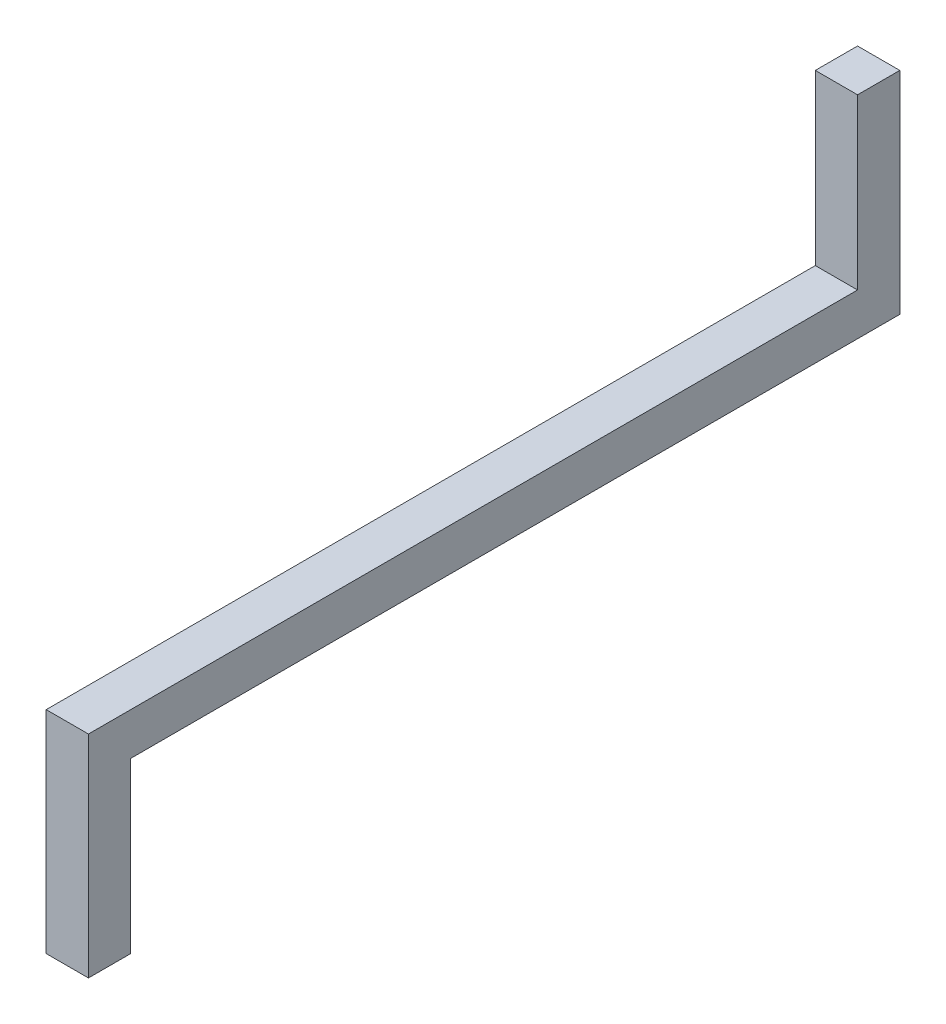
ISO-10303-21;
HEADER;
FILE_DESCRIPTION(('STEP AP214'),'2;1');
FILE_NAME('part.step','',(''),(''),'','','');
FILE_SCHEMA(('AUTOMOTIVE_DESIGN { 1 0 10303 214 1 1 1 1 }'));
ENDSEC;
DATA;
#1=APPLICATION_CONTEXT('core data for automotive mechanical design processes');
#2=APPLICATION_PROTOCOL_DEFINITION('international standard','automotive_design',2000,#1);
#3=PRODUCT_CONTEXT('',#1,'mechanical');
#4=PRODUCT('Part','Part','',(#3));
#5=PRODUCT_RELATED_PRODUCT_CATEGORY('part','',(#4));
#6=PRODUCT_DEFINITION_FORMATION('','',#4);
#7=PRODUCT_DEFINITION_CONTEXT('part definition',#1,'design');
#8=PRODUCT_DEFINITION('design','',#6,#7);
#9=PRODUCT_DEFINITION_SHAPE('','',#8);
#10=(LENGTH_UNIT() NAMED_UNIT(*) SI_UNIT(.MILLI.,.METRE.));
#11=(NAMED_UNIT(*) PLANE_ANGLE_UNIT() SI_UNIT($,.RADIAN.));
#12=(NAMED_UNIT(*) SI_UNIT($,.STERADIAN.) SOLID_ANGLE_UNIT());
#13=UNCERTAINTY_MEASURE_WITH_UNIT(LENGTH_MEASURE(1.E-05),#10,'distance_accuracy_value','');
#14=(GEOMETRIC_REPRESENTATION_CONTEXT(3) GLOBAL_UNCERTAINTY_ASSIGNED_CONTEXT((#13)) GLOBAL_UNIT_ASSIGNED_CONTEXT((#10,
#11,#12)) REPRESENTATION_CONTEXT('',''));
#15=CARTESIAN_POINT('',(0.,0.,0.));
#16=DIRECTION('',(0.,0.,1.));
#17=DIRECTION('',(1.,0.,0.));
#18=AXIS2_PLACEMENT_3D('',#15,#16,#17);
#19=CARTESIAN_POINT('',(3.175,0.,0.));
#20=DIRECTION('',(0.,0.,1.));
#21=DIRECTION('',(1.,0.,0.));
#22=AXIS2_PLACEMENT_3D('',#19,#20,#21);
#23=PLANE('',#22);
#24=DIRECTION('',(0.,1.,0.));
#25=VECTOR('',#24,1.);
#26=CARTESIAN_POINT('',(0.,0.,0.));
#27=LINE('',#26,#25);
#28=CARTESIAN_POINT('',(0.,0.,0.));
#29=VERTEX_POINT('',#28);
#30=CARTESIAN_POINT('',(0.,12.7,0.));
#31=VERTEX_POINT('',#30);
#32=EDGE_CURVE('E129',#29,#31,#27,.T.);
#33=ORIENTED_EDGE('',*,*,#32,.T.);
#34=DIRECTION('',(-1.,0.,0.));
#35=VECTOR('',#34,1.);
#36=CARTESIAN_POINT('',(3.175,12.7,0.));
#37=LINE('',#36,#35);
#38=CARTESIAN_POINT('',(3.175,12.7,0.));
#39=VERTEX_POINT('',#38);
#40=EDGE_CURVE('E11',#39,#31,#37,.T.);
#41=ORIENTED_EDGE('',*,*,#40,.F.);
#42=DIRECTION('',(0.,1.,0.));
#43=VECTOR('',#42,1.);
#44=CARTESIAN_POINT('',(3.175,0.,0.));
#45=LINE('',#44,#43);
#46=CARTESIAN_POINT('',(3.175,0.,0.));
#47=VERTEX_POINT('',#46);
#48=EDGE_CURVE('E144',#47,#39,#45,.T.);
#49=ORIENTED_EDGE('',*,*,#48,.F.);
#50=DIRECTION('',(-1.,0.,0.));
#51=VECTOR('',#50,1.);
#52=CARTESIAN_POINT('',(3.175,0.,0.));
#53=LINE('',#52,#51);
#54=EDGE_CURVE('E125',#47,#29,#53,.T.);
#55=ORIENTED_EDGE('',*,*,#54,.T.);
#56=EDGE_LOOP('',(#33,#41,#49,#55));
#57=FACE_BOUND('',#56,.T.);
#58=ADVANCED_FACE('F33',(#57),#23,.F.);
#59=CARTESIAN_POINT('',(3.175,12.7,-57.785));
#60=DIRECTION('',(0.,1.,0.));
#61=DIRECTION('',(0.,0.,1.));
#62=AXIS2_PLACEMENT_3D('',#59,#60,#61);
#63=PLANE('',#62);
#64=DIRECTION('',(0.,0.,-1.));
#65=VECTOR('',#64,1.);
#66=CARTESIAN_POINT('',(0.,12.7,-57.785));
#67=LINE('',#66,#65);
#68=CARTESIAN_POINT('',(0.,12.7,-57.785));
#69=VERTEX_POINT('',#68);
#70=EDGE_CURVE('E132',#31,#69,#67,.T.);
#71=ORIENTED_EDGE('',*,*,#70,.T.);
#72=DIRECTION('',(-1.,0.,0.));
#73=VECTOR('',#72,1.);
#74=CARTESIAN_POINT('',(3.175,12.7,-57.785));
#75=LINE('',#74,#73);
#76=CARTESIAN_POINT('',(3.175,12.7,-57.785));
#77=VERTEX_POINT('',#76);
#78=EDGE_CURVE('E41',#77,#69,#75,.T.);
#79=ORIENTED_EDGE('',*,*,#78,.F.);
#80=DIRECTION('',(0.,0.,-1.));
#81=VECTOR('',#80,1.);
#82=CARTESIAN_POINT('',(3.175,12.7,-57.785));
#83=LINE('',#82,#81);
#84=EDGE_CURVE('E92',#39,#77,#83,.T.);
#85=ORIENTED_EDGE('',*,*,#84,.F.);
#86=ORIENTED_EDGE('',*,*,#40,.T.);
#87=EDGE_LOOP('',(#71,#79,#85,#86));
#88=FACE_BOUND('',#87,.T.);
#89=ADVANCED_FACE('F159',(#88),#63,.F.);
#90=CARTESIAN_POINT('',(3.175,28.575,-57.785));
#91=DIRECTION('',(0.,0.,1.));
#92=DIRECTION('',(1.,0.,0.));
#93=AXIS2_PLACEMENT_3D('',#90,#91,#92);
#94=PLANE('',#93);
#95=DIRECTION('',(0.,1.,0.));
#96=VECTOR('',#95,1.);
#97=CARTESIAN_POINT('',(0.,28.575,-57.785));
#98=LINE('',#97,#96);
#99=CARTESIAN_POINT('',(0.,28.575,-57.785));
#100=VERTEX_POINT('',#99);
#101=EDGE_CURVE('E135',#69,#100,#98,.T.);
#102=ORIENTED_EDGE('',*,*,#101,.T.);
#103=DIRECTION('',(-1.,0.,0.));
#104=VECTOR('',#103,1.);
#105=CARTESIAN_POINT('',(3.175,28.575,-57.785));
#106=LINE('',#105,#104);
#107=CARTESIAN_POINT('',(3.175,28.575,-57.785));
#108=VERTEX_POINT('',#107);
#109=EDGE_CURVE('E151',#108,#100,#106,.T.);
#110=ORIENTED_EDGE('',*,*,#109,.F.);
#111=DIRECTION('',(0.,1.,0.));
#112=VECTOR('',#111,1.);
#113=CARTESIAN_POINT('',(3.175,15.875,-57.785));
#114=LINE('',#113,#112);
#115=EDGE_CURVE('E158',#77,#108,#114,.T.);
#116=ORIENTED_EDGE('',*,*,#115,.F.);
#117=ORIENTED_EDGE('',*,*,#78,.T.);
#118=EDGE_LOOP('',(#102,#110,#116,#117));
#119=FACE_BOUND('',#118,.T.);
#120=ADVANCED_FACE('F156',(#119),#94,.F.);
#121=CARTESIAN_POINT('',(3.175,28.575,-54.61));
#122=DIRECTION('',(0.,-1.,0.));
#123=DIRECTION('',(0.,0.,-1.));
#124=AXIS2_PLACEMENT_3D('',#121,#122,#123);
#125=PLANE('',#124);
#126=DIRECTION('',(0.,0.,1.));
#127=VECTOR('',#126,1.);
#128=CARTESIAN_POINT('',(0.,28.575,-54.61));
#129=LINE('',#128,#127);
#130=CARTESIAN_POINT('',(0.,28.575,-54.61));
#131=VERTEX_POINT('',#130);
#132=EDGE_CURVE('E137',#100,#131,#129,.T.);
#133=ORIENTED_EDGE('',*,*,#132,.T.);
#134=DIRECTION('',(-1.,0.,0.));
#135=VECTOR('',#134,1.);
#136=CARTESIAN_POINT('',(3.175,28.575,-54.61));
#137=LINE('',#136,#135);
#138=CARTESIAN_POINT('',(3.175,28.575,-54.61));
#139=VERTEX_POINT('',#138);
#140=EDGE_CURVE('E148',#139,#131,#137,.T.);
#141=ORIENTED_EDGE('',*,*,#140,.F.);
#142=DIRECTION('',(0.,0.,1.));
#143=VECTOR('',#142,1.);
#144=CARTESIAN_POINT('',(3.175,28.575,-54.61));
#145=LINE('',#144,#143);
#146=EDGE_CURVE('E172',#108,#139,#145,.T.);
#147=ORIENTED_EDGE('',*,*,#146,.F.);
#148=ORIENTED_EDGE('',*,*,#109,.T.);
#149=EDGE_LOOP('',(#133,#141,#147,#148));
#150=FACE_BOUND('',#149,.T.);
#151=ADVANCED_FACE('F168',(#150),#125,.F.);
#152=CARTESIAN_POINT('',(3.175,15.875,-54.61));
#153=DIRECTION('',(0.,0.,-1.));
#154=DIRECTION('',(-1.,0.,0.));
#155=AXIS2_PLACEMENT_3D('',#152,#153,#154);
#156=PLANE('',#155);
#157=DIRECTION('',(0.,-1.,0.));
#158=VECTOR('',#157,1.);
#159=CARTESIAN_POINT('',(0.,15.875,-54.61));
#160=LINE('',#159,#158);
#161=CARTESIAN_POINT('',(0.,15.875,-54.61));
#162=VERTEX_POINT('',#161);
#163=EDGE_CURVE('E139',#131,#162,#160,.T.);
#164=ORIENTED_EDGE('',*,*,#163,.T.);
#165=DIRECTION('',(-1.,0.,0.));
#166=VECTOR('',#165,1.);
#167=CARTESIAN_POINT('',(3.175,15.875,-54.61));
#168=LINE('',#167,#166);
#169=CARTESIAN_POINT('',(3.175,15.875,-54.61));
#170=VERTEX_POINT('',#169);
#171=EDGE_CURVE('E120',#170,#162,#168,.T.);
#172=ORIENTED_EDGE('',*,*,#171,.F.);
#173=DIRECTION('',(0.,-1.,0.));
#174=VECTOR('',#173,1.);
#175=CARTESIAN_POINT('',(3.175,15.875,-54.61));
#176=LINE('',#175,#174);
#177=EDGE_CURVE('E111',#139,#170,#176,.T.);
#178=ORIENTED_EDGE('',*,*,#177,.F.);
#179=ORIENTED_EDGE('',*,*,#140,.T.);
#180=EDGE_LOOP('',(#164,#172,#178,#179));
#181=FACE_BOUND('',#180,.T.);
#182=ADVANCED_FACE('F171',(#181),#156,.F.);
#183=CARTESIAN_POINT('',(3.175,15.875,3.175));
#184=DIRECTION('',(0.,-1.,0.));
#185=DIRECTION('',(0.,0.,-1.));
#186=AXIS2_PLACEMENT_3D('',#183,#184,#185);
#187=PLANE('',#186);
#188=DIRECTION('',(0.,0.,1.));
#189=VECTOR('',#188,1.);
#190=CARTESIAN_POINT('',(0.,15.875,3.175));
#191=LINE('',#190,#189);
#192=CARTESIAN_POINT('',(0.,15.875,3.175));
#193=VERTEX_POINT('',#192);
#194=EDGE_CURVE('E119',#162,#193,#191,.T.);
#195=ORIENTED_EDGE('',*,*,#194,.T.);
#196=DIRECTION('',(-1.,0.,0.));
#197=VECTOR('',#196,1.);
#198=CARTESIAN_POINT('',(3.175,15.875,3.175));
#199=LINE('',#198,#197);
#200=CARTESIAN_POINT('',(3.175,15.875,3.175));
#201=VERTEX_POINT('',#200);
#202=EDGE_CURVE('E116',#201,#193,#199,.T.);
#203=ORIENTED_EDGE('',*,*,#202,.F.);
#204=DIRECTION('',(0.,0.,1.));
#205=VECTOR('',#204,1.);
#206=CARTESIAN_POINT('',(3.175,15.875,3.175));
#207=LINE('',#206,#205);
#208=EDGE_CURVE('E105',#170,#201,#207,.T.);
#209=ORIENTED_EDGE('',*,*,#208,.F.);
#210=ORIENTED_EDGE('',*,*,#171,.T.);
#211=EDGE_LOOP('',(#195,#203,#209,#210));
#212=FACE_BOUND('',#211,.T.);
#213=ADVANCED_FACE('F117',(#212),#187,.F.);
#214=CARTESIAN_POINT('',(3.175,0.,3.175));
#215=DIRECTION('',(0.,0.,-1.));
#216=DIRECTION('',(-1.,0.,0.));
#217=AXIS2_PLACEMENT_3D('',#214,#215,#216);
#218=PLANE('',#217);
#219=DIRECTION('',(0.,-1.,0.));
#220=VECTOR('',#219,1.);
#221=CARTESIAN_POINT('',(0.,0.,3.175));
#222=LINE('',#221,#220);
#223=CARTESIAN_POINT('',(0.,0.,3.175));
#224=VERTEX_POINT('',#223);
#225=EDGE_CURVE('E78',#193,#224,#222,.T.);
#226=ORIENTED_EDGE('',*,*,#225,.T.);
#227=DIRECTION('',(-1.,0.,0.));
#228=VECTOR('',#227,1.);
#229=CARTESIAN_POINT('',(3.175,0.,3.175));
#230=LINE('',#229,#228);
#231=CARTESIAN_POINT('',(3.175,0.,3.175));
#232=VERTEX_POINT('',#231);
#233=EDGE_CURVE('E121',#232,#224,#230,.T.);
#234=ORIENTED_EDGE('',*,*,#233,.F.);
#235=DIRECTION('',(0.,-1.,0.));
#236=VECTOR('',#235,1.);
#237=CARTESIAN_POINT('',(3.175,0.,3.175));
#238=LINE('',#237,#236);
#239=EDGE_CURVE('E109',#201,#232,#238,.T.);
#240=ORIENTED_EDGE('',*,*,#239,.F.);
#241=ORIENTED_EDGE('',*,*,#202,.T.);
#242=EDGE_LOOP('',(#226,#234,#240,#241));
#243=FACE_BOUND('',#242,.T.);
#244=ADVANCED_FACE('F123',(#243),#218,.F.);
#245=CARTESIAN_POINT('',(3.175,0.,0.));
#246=DIRECTION('',(0.,1.,0.));
#247=DIRECTION('',(0.,0.,1.));
#248=AXIS2_PLACEMENT_3D('',#245,#246,#247);
#249=PLANE('',#248);
#250=DIRECTION('',(0.,0.,-1.));
#251=VECTOR('',#250,1.);
#252=CARTESIAN_POINT('',(0.,0.,0.));
#253=LINE('',#252,#251);
#254=EDGE_CURVE('E84',#224,#29,#253,.T.);
#255=ORIENTED_EDGE('',*,*,#254,.T.);
#256=ORIENTED_EDGE('',*,*,#54,.F.);
#257=DIRECTION('',(0.,0.,-1.));
#258=VECTOR('',#257,1.);
#259=CARTESIAN_POINT('',(3.175,0.,0.));
#260=LINE('',#259,#258);
#261=EDGE_CURVE('E49',#232,#47,#260,.T.);
#262=ORIENTED_EDGE('',*,*,#261,.F.);
#263=ORIENTED_EDGE('',*,*,#233,.T.);
#264=EDGE_LOOP('',(#255,#256,#262,#263));
#265=FACE_BOUND('',#264,.T.);
#266=ADVANCED_FACE('F179',(#265),#249,.F.);
#267=CARTESIAN_POINT('',(3.175,12.7,0.));
#268=DIRECTION('',(1.,0.,0.));
#269=DIRECTION('',(0.,0.,-1.));
#270=AXIS2_PLACEMENT_3D('',#267,#268,#269);
#271=PLANE('',#270);
#272=ORIENTED_EDGE('',*,*,#48,.T.);
#273=ORIENTED_EDGE('',*,*,#84,.T.);
#274=ORIENTED_EDGE('',*,*,#115,.T.);
#275=ORIENTED_EDGE('',*,*,#146,.T.);
#276=ORIENTED_EDGE('',*,*,#177,.T.);
#277=ORIENTED_EDGE('',*,*,#208,.T.);
#278=ORIENTED_EDGE('',*,*,#239,.T.);
#279=ORIENTED_EDGE('',*,*,#261,.T.);
#280=EDGE_LOOP('',(#272,#273,#274,#275,#276,#277,#278,#279));
#281=FACE_BOUND('',#280,.T.);
#282=ADVANCED_FACE('F107',(#281),#271,.T.);
#283=CARTESIAN_POINT('',(0.,12.7,0.));
#284=DIRECTION('',(1.,0.,0.));
#285=DIRECTION('',(0.,0.,-1.));
#286=AXIS2_PLACEMENT_3D('',#283,#284,#285);
#287=PLANE('',#286);
#288=ORIENTED_EDGE('',*,*,#32,.F.);
#289=ORIENTED_EDGE('',*,*,#254,.F.);
#290=ORIENTED_EDGE('',*,*,#225,.F.);
#291=ORIENTED_EDGE('',*,*,#194,.F.);
#292=ORIENTED_EDGE('',*,*,#163,.F.);
#293=ORIENTED_EDGE('',*,*,#132,.F.);
#294=ORIENTED_EDGE('',*,*,#101,.F.);
#295=ORIENTED_EDGE('',*,*,#70,.F.);
#296=EDGE_LOOP('',(#288,#289,#290,#291,#292,#293,#294,#295));
#297=FACE_BOUND('',#296,.T.);
#298=ADVANCED_FACE('F163',(#297),#287,.F.);
#299=CLOSED_SHELL('',(#58,#89,#120,#151,#182,#213,#244,#266,#282,#298));
#300=MANIFOLD_SOLID_BREP('B2',#299);
#301=ADVANCED_BREP_SHAPE_REPRESENTATION('',(#18,#300),#14);
#302=SHAPE_DEFINITION_REPRESENTATION(#9,#301);
ENDSEC;
END-ISO-10303-21;
